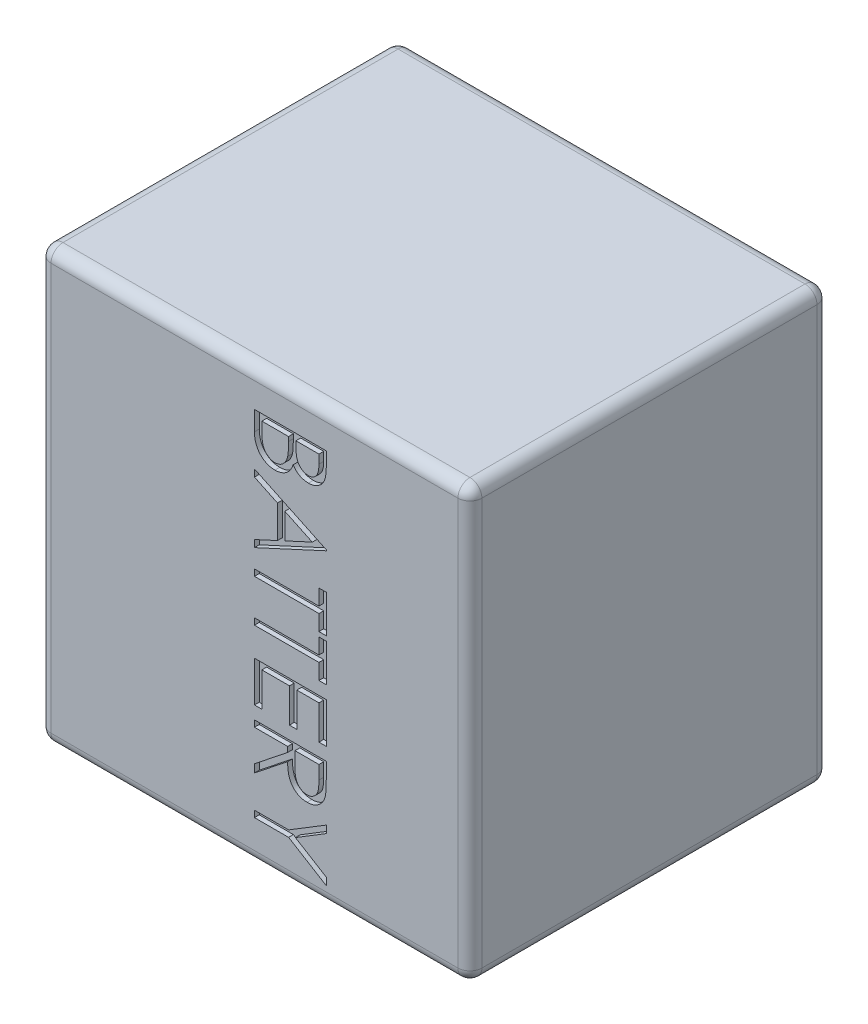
from build123d import *

# Parameters (mm, degrees)
ESQUISSE1_W             = 180
ESQUISSE1_H             = 180
BOSS_EXTRU_1_DEPTH      = 150
CONG_1_R                = 5
ENL_V_MAT_EXTRU_1_DEPTH = 2
ENL_V_MAT_EXTRU_2_DEPTH = 2
ENL_V_MAT_EXTRU_3_DEPTH = 2


with BuildPart() as part:
    # Esquisse1 → Boss.-Extru.1 (new body)
    with BuildSketch(Plane.XY):
        with Locations((-90, -90)):
            Rectangle(ESQUISSE1_W, ESQUISSE1_H)
    extrude(amount=BOSS_EXTRU_1_DEPTH)

    # Cong_1
    cong_1_edges = [part.edges().sort_by_distance(p)[0] for p in [
        (-180, -90, 150),
        (-90, -180, 150),
        (0, -90, 150),
        (-90, -180, 0),
        (-180, -90, 0),
        (-90, 0, 0),
        (0, -90, 0),
        (0, -180, 75),
        (-180, -180, 75),
        (-180, 0, 75),
        (0, 0, 75),
        (-90, 0, 150),
    ]]
    fillet(cong_1_edges, radius=CONG_1_R)

    # Esquisse2 → Enl_v. mat.-Extru.1 (cut)
    # profile 1 of 7: a face of its own
    with BuildSketch(Plane.XY.offset(150)):
        with BuildLine():
            Line((-60, -15.384615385), (-60, -21.237980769))
            add(Edge.make_bspline(
                [(-60, -21.237980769), (-60.001506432, -21.524510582), (-60.004426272, -22.079876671), (-60.049710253, -22.887471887), (-60.111455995, -23.643890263), (-60.209428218, -24.349351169), (-60.327643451, -25.003528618), (-60.470801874, -25.60839408), (-60.642458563, -26.162024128), (-60.915426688, -26.82299044), (-61.321053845, -27.576596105), (-61.920441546, -28.392582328), (-62.653576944, -29.090332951), (-63.480571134, -29.691929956), (-64.39030632, -30.170225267), (-65.361099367, -30.516247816), (-66.380428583, -30.735315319), (-67.080227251, -30.757844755), (-67.433894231, -30.769230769)],
                knots=[0, 0, 0, 0, 1.001505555, 1.941167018, 2.826882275, 3.653841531, 4.429895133, 5.150066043, 5.825578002, 6.45369114, 7.647487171, 8.808567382, 9.977351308, 11.170798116, 12.373658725, 13.556498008, 14.765093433, 16, 16, 16, 16], degree=3))
            add(Edge.make_bspline(
                [(-67.433894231, -30.769230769), (-67.765257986, -30.760041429), (-68.416419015, -30.741983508), (-69.36727989, -30.563426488), (-70.276147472, -30.297580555), (-71.131817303, -29.911650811), (-71.923292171, -29.415225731), (-72.645868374, -28.817835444), (-73.282034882, -28.106564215), (-73.636203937, -27.572807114), (-73.816105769, -27.301682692)],
                knots=[0, 0, 0, 0, 1.044266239, 2.052081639, 3.041743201, 4.026043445, 5.00270663, 5.980942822, 6.97441044, 8, 8, 8, 8], degree=3))
            add(Edge.make_bspline(
                [(-73.816105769, -27.301682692), (-73.946847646, -27.642543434), (-74.196989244, -28.294694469), (-74.641642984, -29.19278574), (-75.119819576, -29.96965462), (-75.644776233, -30.626156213), (-76.217699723, -31.179157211), (-76.827117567, -31.675763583), (-77.50303226, -32.091808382), (-78.226197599, -32.449225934), (-78.991538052, -32.7305098), (-79.795553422, -32.929536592), (-80.629253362, -33.051828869), (-81.197504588, -33.068504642), (-81.484375, -33.076923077)],
                knots=[0, 0, 0, 0, 1.272302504, 2.434229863, 3.488457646, 4.447234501, 5.35599188, 6.26022912, 7.18267843, 8.11661068, 9.06895546, 10.019249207, 11.000057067, 12, 12, 12, 12], degree=3))
            add(Edge.make_bspline(
                [(-81.484375, -33.076923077), (-81.777232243, -33.068547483), (-82.353437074, -33.052068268), (-83.199933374, -32.930563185), (-84.008774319, -32.724632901), (-84.785710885, -32.441673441), (-85.526345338, -32.070277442), (-86.239953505, -31.628041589), (-86.907525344, -31.08978451), (-87.544936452, -30.489820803), (-88.117708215, -29.810297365), (-88.627634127, -29.077251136), (-89.048919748, -28.280138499), (-89.398386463, -27.431320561), (-89.669221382, -26.525156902), (-89.857247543, -25.565007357), (-89.9842348, -24.550663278), (-89.994655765, -23.854574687), (-90, -23.497596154)],
                knots=[0, 0, 0, 0, 0.978404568, 1.925038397, 2.85041836, 3.763147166, 4.682162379, 5.614488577, 6.562659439, 7.54271123, 8.535210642, 9.526693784, 10.520907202, 11.541451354, 12.589717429, 13.675358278, 14.807842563, 16, 16, 16, 16], degree=3))
            Line((-90, -23.497596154), (-90, -15.384615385))
            Line((-90, -15.384615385), (-60, -15.384615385))
        make_face()
        with BuildLine():
            Line((-63.076923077, -18.076923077), (-72.692307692, -18.076923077))
            Line((-72.692307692, -18.076923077), (-72.692307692, -19.885817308))
            add(Edge.make_bspline(
                [(-72.692307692, -19.885817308), (-72.688908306, -20.150237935), (-72.68234, -20.661152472), (-72.662931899, -21.403003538), (-72.610968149, -22.089894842), (-72.556007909, -22.724193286), (-72.471380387, -23.301647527), (-72.367820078, -23.824190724), (-72.259253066, -24.296516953), (-72.074099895, -24.840965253), (-71.803237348, -25.458362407), (-71.372996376, -26.11234795), (-70.874468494, -26.698250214), (-70.288623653, -27.187471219), (-69.649010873, -27.591164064), (-68.955573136, -27.860571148), (-68.235382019, -28.051658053), (-67.73966656, -28.068415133), (-67.487980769, -28.076923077)],
                knots=[0, 0, 0, 0, 1.156481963, 2.23455883, 3.244418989, 4.168404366, 5.01828131, 5.794834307, 6.498111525, 7.13526334, 8.307595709, 9.435046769, 10.546766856, 11.659452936, 12.760769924, 13.837671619, 14.902137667, 16, 16, 16, 16], degree=3))
            add(Edge.make_bspline(
                [(-67.487980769, -28.076923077), (-67.321395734, -28.072667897), (-66.994620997, -28.064320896), (-66.520093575, -27.988353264), (-66.068089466, -27.878123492), (-65.649004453, -27.70591096), (-65.25092694, -27.497670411), (-64.891538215, -27.22678725), (-64.551148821, -26.920868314), (-64.242257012, -26.561596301), (-63.965488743, -26.150710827), (-63.721956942, -25.684296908), (-63.529852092, -25.156785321), (-63.357523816, -24.580136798), (-63.237946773, -23.945122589), (-63.13796444, -23.25794765), (-63.087140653, -22.512782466), (-63.080404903, -21.997254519), (-63.076923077, -21.730769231)],
                knots=[0, 0, 0, 0, 0.911752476, 1.788502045, 2.626783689, 3.45400582, 4.26402138, 5.080402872, 5.911472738, 6.767166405, 7.66795952, 8.620018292, 9.640966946, 10.73819047, 11.913090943, 13.176185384, 14.540321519, 16, 16, 16, 16], degree=3))
            Line((-63.076923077, -21.730769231), (-63.076923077, -18.076923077))
        make_face(mode=Mode.SUBTRACT)
        with BuildLine():
            Line((-75.769230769, -18.076923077), (-86.923076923, -18.076923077))
            Line((-86.923076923, -18.076923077), (-86.923076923, -21.911057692))
            add(Edge.make_bspline(
                [(-86.923076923, -21.911057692), (-86.919799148, -22.185506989), (-86.913481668, -22.714471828), (-86.892632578, -23.478178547), (-86.846204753, -24.184107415), (-86.770515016, -24.832664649), (-86.691866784, -25.429559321), (-86.583013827, -25.968861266), (-86.459261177, -26.451397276), (-86.267748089, -27.01083891), (-85.970736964, -27.641210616), (-85.519990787, -28.320057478), (-84.990067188, -28.929634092), (-84.369016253, -29.441343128), (-83.698842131, -29.863892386), (-82.983050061, -30.160250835), (-82.24347672, -30.350805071), (-81.73791829, -30.373322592), (-81.484375, -30.384615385)],
                knots=[0, 0, 0, 0, 1.159821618, 2.235403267, 3.228114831, 4.14795534, 4.994323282, 5.771256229, 6.471395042, 7.097801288, 8.267864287, 9.404187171, 10.531774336, 11.667624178, 12.792825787, 13.866573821, 14.930062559, 16, 16, 16, 16], degree=3))
            add(Edge.make_bspline(
                [(-81.484375, -30.384615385), (-81.325840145, -30.382307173), (-81.011327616, -30.377727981), (-80.549491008, -30.306071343), (-80.100128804, -30.206105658), (-79.670036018, -30.061346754), (-79.252214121, -29.878817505), (-78.853940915, -29.649750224), (-78.465693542, -29.385220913), (-77.975425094, -28.971409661), (-77.410360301, -28.370082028), (-76.857202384, -27.515403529), (-76.411072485, -26.543654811), (-76.221649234, -25.838845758), (-76.123798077, -25.474759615)],
                knots=[0, 0, 0, 0, 0.723503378, 1.435336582, 2.130201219, 2.824764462, 3.504949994, 4.209866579, 4.920640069, 5.648298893, 7.13757748, 8.670694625, 10.280166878, 12, 12, 12, 12], degree=3))
            add(Edge.make_bspline(
                [(-76.123798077, -25.474759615), (-76.094181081, -25.328796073), (-76.029965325, -25.012317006), (-75.96222329, -24.496249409), (-75.901456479, -23.905109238), (-75.857687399, -23.241423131), (-75.810702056, -22.502551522), (-75.793079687, -21.688731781), (-75.771570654, -20.79938857), (-75.770030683, -20.182310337), (-75.769230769, -19.861778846)],
                knots=[0, 0, 0, 0, 0.634452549, 1.375623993, 2.216454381, 3.166361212, 4.209414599, 5.370755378, 6.634280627, 8, 8, 8, 8], degree=3))
            Line((-75.769230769, -19.861778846), (-75.769230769, -18.076923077))
        make_face(mode=Mode.SUBTRACT)
    # profile 2 of 7: a face of its own
    with BuildSketch(Plane.XY.offset(150)):
        Polygon((-60, -51.538461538), (-90, -65.384615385), (-90, -62.457932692), (-80.384615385, -58.022836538), (-80.384615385, -44.423076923), (-90, -39.861778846), (-90, -36.923076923), (-60, -51.153846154), align=None)
        Polygon((-65.847355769, -51.316105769), (-77.307692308, -45.883413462), (-77.307692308, -56.604567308), align=None, mode=Mode.SUBTRACT)
    # profile 3 of 7: a face of its own
    with BuildSketch(Plane.XY.offset(150)):
        Polygon((-63.076923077, -66.538461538), (-60, -66.538461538), (-60, -82.307692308), (-63.076923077, -82.307692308), (-63.076923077, -75.769230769), (-90, -75.769230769), (-90, -73.076923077), (-63.076923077, -73.076923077), align=None)
    # profile 4 of 7: a face of its own
    with BuildSketch(Plane.XY.offset(150)):
        Polygon((-63.076923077, -84.230769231), (-60, -84.230769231), (-60, -100), (-63.076923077, -100), (-63.076923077, -93.461538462), (-90, -93.461538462), (-90, -90.769230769), (-63.076923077, -90.769230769), align=None)
    # profile 5 of 7: a face of its own
    with BuildSketch(Plane.XY.offset(150)):
        Polygon((-60, -105.384615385), (-60, -122.307692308), (-63.076923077, -122.307692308), (-63.076923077, -108.076923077), (-72.307692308, -108.076923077), (-72.307692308, -122.307692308), (-75.384615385, -122.307692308), (-75.384615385, -108.076923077), (-86.923076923, -108.076923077), (-86.923076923, -122.307692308), (-90, -122.307692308), (-90, -105.384615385), align=None)
    # profile 6 of 7: a face of its own
    with BuildSketch(Plane.XY.offset(150)):
        with BuildLine():
            Line((-60, -127.692307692), (-60, -133.695913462))
            add(Edge.make_bspline(
                [(-60, -133.695913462), (-60.001333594, -134.096551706), (-60.003894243, -134.865821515), (-60.018172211, -135.967878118), (-60.059095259, -136.969253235), (-60.094311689, -137.869423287), (-60.158528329, -138.668371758), (-60.219905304, -139.368548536), (-60.300250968, -139.9667288), (-60.374868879, -140.328836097), (-60.408653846, -140.492788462)],
                knots=[0, 0, 0, 0, 1.410062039, 2.707475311, 3.878576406, 4.937260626, 5.877586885, 6.699081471, 7.410979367, 8, 8, 8, 8], degree=3))
            add(Edge.make_bspline(
                [(-60.408653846, -140.492788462), (-60.462877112, -140.712277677), (-60.570166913, -141.146573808), (-60.797052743, -141.771804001), (-61.05917739, -142.36784799), (-61.369442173, -142.932468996), (-61.722435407, -143.465719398), (-62.120219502, -143.966800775), (-62.564820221, -144.432848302), (-63.044884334, -144.867447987), (-63.564600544, -145.261398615), (-64.116397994, -145.602311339), (-64.696825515, -145.894233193), (-65.307904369, -146.127283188), (-65.944468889, -146.314764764), (-66.612077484, -146.44700178), (-67.307745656, -146.526294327), (-67.782241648, -146.534367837), (-68.022836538, -146.538461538)],
                knots=[0, 0, 0, 0, 1.02737288, 2.032829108, 3.019628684, 3.985738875, 4.958353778, 5.924249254, 6.890702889, 7.883913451, 8.865824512, 9.85161466, 10.829249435, 11.81541824, 12.821369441, 13.843154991, 14.906364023, 16, 16, 16, 16], degree=3))
            add(Edge.make_bspline(
                [(-68.022836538, -146.538461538), (-68.422566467, -146.525870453), (-69.202543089, -146.501301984), (-70.334487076, -146.272225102), (-71.390418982, -145.897014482), (-72.368869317, -145.379896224), (-73.251280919, -144.721671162), (-74.023710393, -143.930634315), (-74.676062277, -143.010825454), (-75.123633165, -142.150523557), (-75.411619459, -141.390217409), (-75.615264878, -140.76244881), (-75.76995325, -140.077139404), (-75.910543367, -139.344120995), (-76.01782492, -138.557731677), (-76.094015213, -137.719555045), (-76.14300615, -136.827494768), (-76.150163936, -136.216011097), (-76.153846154, -135.901442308)],
                knots=[0, 0, 0, 0, 1.260402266, 2.459371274, 3.627181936, 4.786749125, 5.93865593, 7.087644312, 8.261344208, 9.485713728, 10.136162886, 10.825977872, 11.566646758, 12.35154167, 13.181268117, 14.0701832, 15.007234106, 16, 16, 16, 16], degree=3))
            Line((-76.153846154, -135.901442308), (-90, -146.923076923))
            Line((-90, -146.923076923), (-90, -143.59375))
            Line((-90, -143.59375), (-76.153846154, -132.572115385))
            Line((-76.153846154, -132.572115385), (-76.153846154, -130.384615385))
            Line((-76.153846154, -130.384615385), (-90, -130.384615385))
            Line((-90, -130.384615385), (-90, -127.692307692))
            Line((-90, -127.692307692), (-60, -127.692307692))
        make_face()
        with BuildLine():
            Line((-63.076923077, -130.384615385), (-73.076923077, -130.384615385))
            Line((-73.076923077, -130.384615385), (-73.118990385, -135.877403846))
            add(Edge.make_bspline(
                [(-73.118990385, -135.877403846), (-73.119103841, -136.133861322), (-73.119323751, -136.630948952), (-73.085091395, -137.350097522), (-73.046148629, -138.01969843), (-72.986582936, -138.637190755), (-72.909816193, -139.202849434), (-72.813791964, -139.716394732), (-72.701912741, -140.178655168), (-72.528774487, -140.717809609), (-72.254311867, -141.319674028), (-71.85567055, -141.97458297), (-71.351022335, -142.530398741), (-70.783136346, -143.009619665), (-70.145915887, -143.378741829), (-69.467644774, -143.647398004), (-68.754178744, -143.815994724), (-68.264134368, -143.836038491), (-68.016826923, -143.846153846)],
                knots=[0, 0, 0, 0, 1.14660753, 2.222451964, 3.218720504, 4.145691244, 4.995719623, 5.770487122, 6.480909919, 7.121111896, 8.299844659, 9.430703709, 10.534634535, 11.641396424, 12.741395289, 13.810956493, 14.895269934, 16, 16, 16, 16], degree=3))
            add(Edge.make_bspline(
                [(-68.016826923, -143.846153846), (-67.775503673, -143.836007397), (-67.297289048, -143.815900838), (-66.599116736, -143.647071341), (-65.935457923, -143.374436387), (-65.318962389, -142.992139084), (-64.754688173, -142.530191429), (-64.278554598, -141.981559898), (-63.87982048, -141.37387425), (-63.626876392, -140.805500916), (-63.471488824, -140.297831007), (-63.362278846, -139.856984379), (-63.273797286, -139.356972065), (-63.205004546, -138.798992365), (-63.14309894, -138.184054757), (-63.102960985, -137.510475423), (-63.078701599, -136.779032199), (-63.077529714, -136.272056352), (-63.076923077, -136.009615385)],
                knots=[0, 0, 0, 0, 1.100801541, 2.181386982, 3.260112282, 4.364594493, 5.481957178, 6.577424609, 7.668452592, 8.790448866, 9.403819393, 10.091598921, 10.863153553, 11.720938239, 12.658472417, 13.685008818, 14.801622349, 16, 16, 16, 16], degree=3))
            Line((-63.076923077, -136.009615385), (-63.076923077, -130.384615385))
        make_face(mode=Mode.SUBTRACT)
    # profile 7 of 7: a face of its own
    with BuildSketch(Plane.XY.offset(150)):
        Polygon((-60, -150.769230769), (-60, -153.852163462), (-72.890625, -161.736778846), (-60, -169.609375), (-60, -172.692307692), (-75.739182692, -163.076923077), (-90, -163.076923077), (-90, -160.384615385), (-75.739182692, -160.384615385), align=None)
    extrude(amount=-ENL_V_MAT_EXTRU_1_DEPTH, mode=Mode.SUBTRACT)

    # Esquisse3 → Enl_v. mat.-Extru.2 (cut)
    # profile 1 of 7: a face of its own
    with BuildSketch(Plane.ZY.offset(180)):
        with BuildLine():
            Line((105, -15.384615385), (105, -21.237980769))
            add(Edge.make_bspline(
                [(105, -21.237980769), (104.998493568, -21.524510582), (104.995573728, -22.079876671), (104.950289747, -22.887471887), (104.888544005, -23.643890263), (104.790571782, -24.349351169), (104.672356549, -25.003528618), (104.529198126, -25.60839408), (104.357541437, -26.162024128), (104.084573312, -26.82299044), (103.678946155, -27.576596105), (103.079558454, -28.392582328), (102.346423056, -29.090332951), (101.519428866, -29.691929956), (100.60969368, -30.170225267), (99.638900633, -30.516247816), (98.619571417, -30.735315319), (97.919772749, -30.757844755), (97.566105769, -30.769230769)],
                knots=[0, 0, 0, 0, 1.001505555, 1.941167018, 2.826882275, 3.653841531, 4.429895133, 5.150066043, 5.825578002, 6.45369114, 7.647487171, 8.808567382, 9.977351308, 11.170798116, 12.373658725, 13.556498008, 14.765093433, 16, 16, 16, 16], degree=3))
            add(Edge.make_bspline(
                [(97.566105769, -30.769230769), (97.234742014, -30.760041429), (96.583580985, -30.741983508), (95.63272011, -30.563426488), (94.723852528, -30.297580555), (93.868182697, -29.911650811), (93.076707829, -29.415225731), (92.354131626, -28.817835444), (91.717965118, -28.106564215), (91.363796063, -27.572807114), (91.183894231, -27.301682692)],
                knots=[0, 0, 0, 0, 1.044266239, 2.052081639, 3.041743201, 4.026043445, 5.00270663, 5.980942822, 6.97441044, 8, 8, 8, 8], degree=3))
            add(Edge.make_bspline(
                [(91.183894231, -27.301682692), (91.053152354, -27.642543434), (90.803010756, -28.294694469), (90.358357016, -29.19278574), (89.880180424, -29.96965462), (89.355223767, -30.626156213), (88.782300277, -31.179157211), (88.172882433, -31.675763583), (87.49696774, -32.091808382), (86.773802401, -32.449225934), (86.008461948, -32.7305098), (85.204446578, -32.929536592), (84.370746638, -33.051828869), (83.802495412, -33.068504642), (83.515625, -33.076923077)],
                knots=[0, 0, 0, 0, 1.272302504, 2.434229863, 3.488457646, 4.447234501, 5.35599188, 6.26022912, 7.18267843, 8.11661068, 9.06895546, 10.019249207, 11.000057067, 12, 12, 12, 12], degree=3))
            add(Edge.make_bspline(
                [(83.515625, -33.076923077), (83.222767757, -33.068547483), (82.646562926, -33.052068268), (81.800066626, -32.930563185), (80.991225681, -32.724632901), (80.214289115, -32.441673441), (79.473654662, -32.070277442), (78.760046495, -31.628041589), (78.092474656, -31.08978451), (77.455063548, -30.489820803), (76.882291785, -29.810297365), (76.372365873, -29.077251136), (75.951080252, -28.280138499), (75.601613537, -27.431320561), (75.330778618, -26.525156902), (75.142752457, -25.565007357), (75.0157652, -24.550663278), (75.005344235, -23.854574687), (75, -23.497596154)],
                knots=[0, 0, 0, 0, 0.978404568, 1.925038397, 2.85041836, 3.763147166, 4.682162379, 5.614488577, 6.562659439, 7.54271123, 8.535210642, 9.526693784, 10.520907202, 11.541451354, 12.589717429, 13.675358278, 14.807842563, 16, 16, 16, 16], degree=3))
            Line((75, -23.497596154), (75, -15.384615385))
            Line((75, -15.384615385), (105, -15.384615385))
        make_face()
        with BuildLine():
            Line((101.923076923, -18.076923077), (92.307692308, -18.076923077))
            Line((92.307692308, -18.076923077), (92.307692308, -19.885817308))
            add(Edge.make_bspline(
                [(92.307692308, -19.885817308), (92.311091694, -20.150237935), (92.31766, -20.661152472), (92.337068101, -21.403003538), (92.389031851, -22.089894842), (92.443992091, -22.724193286), (92.528619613, -23.301647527), (92.632179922, -23.824190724), (92.740746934, -24.296516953), (92.925900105, -24.840965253), (93.196762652, -25.458362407), (93.627003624, -26.11234795), (94.125531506, -26.698250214), (94.711376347, -27.187471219), (95.350989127, -27.591164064), (96.044426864, -27.860571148), (96.764617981, -28.051658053), (97.26033344, -28.068415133), (97.512019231, -28.076923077)],
                knots=[0, 0, 0, 0, 1.156481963, 2.23455883, 3.244418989, 4.168404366, 5.01828131, 5.794834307, 6.498111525, 7.13526334, 8.307595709, 9.435046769, 10.546766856, 11.659452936, 12.760769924, 13.837671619, 14.902137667, 16, 16, 16, 16], degree=3))
            add(Edge.make_bspline(
                [(97.512019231, -28.076923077), (97.678604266, -28.072667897), (98.005379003, -28.064320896), (98.479906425, -27.988353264), (98.931910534, -27.878123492), (99.350995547, -27.70591096), (99.74907306, -27.497670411), (100.108461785, -27.22678725), (100.448851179, -26.920868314), (100.757742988, -26.561596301), (101.034511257, -26.150710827), (101.278043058, -25.684296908), (101.470147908, -25.156785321), (101.642476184, -24.580136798), (101.762053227, -23.945122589), (101.86203556, -23.25794765), (101.912859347, -22.512782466), (101.919595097, -21.997254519), (101.923076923, -21.730769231)],
                knots=[0, 0, 0, 0, 0.911752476, 1.788502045, 2.626783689, 3.45400582, 4.26402138, 5.080402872, 5.911472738, 6.767166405, 7.66795952, 8.620018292, 9.640966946, 10.73819047, 11.913090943, 13.176185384, 14.540321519, 16, 16, 16, 16], degree=3))
            Line((101.923076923, -21.730769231), (101.923076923, -18.076923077))
        make_face(mode=Mode.SUBTRACT)
        with BuildLine():
            Line((89.230769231, -18.076923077), (78.076923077, -18.076923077))
            Line((78.076923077, -18.076923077), (78.076923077, -21.911057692))
            add(Edge.make_bspline(
                [(78.076923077, -21.911057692), (78.080200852, -22.185506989), (78.086518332, -22.714471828), (78.107367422, -23.478178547), (78.153795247, -24.184107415), (78.229484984, -24.832664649), (78.308133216, -25.429559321), (78.416986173, -25.968861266), (78.540738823, -26.451397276), (78.732251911, -27.01083891), (79.029263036, -27.641210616), (79.480009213, -28.320057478), (80.009932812, -28.929634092), (80.630983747, -29.441343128), (81.301157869, -29.863892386), (82.016949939, -30.160250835), (82.75652328, -30.350805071), (83.26208171, -30.373322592), (83.515625, -30.384615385)],
                knots=[0, 0, 0, 0, 1.159821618, 2.235403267, 3.228114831, 4.14795534, 4.994323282, 5.771256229, 6.471395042, 7.097801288, 8.267864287, 9.404187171, 10.531774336, 11.667624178, 12.792825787, 13.866573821, 14.930062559, 16, 16, 16, 16], degree=3))
            add(Edge.make_bspline(
                [(83.515625, -30.384615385), (83.674159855, -30.382307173), (83.988672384, -30.377727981), (84.450508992, -30.306071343), (84.899871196, -30.206105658), (85.329963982, -30.061346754), (85.747785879, -29.878817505), (86.146059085, -29.649750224), (86.534306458, -29.385220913), (87.024574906, -28.971409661), (87.589639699, -28.370082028), (88.142797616, -27.515403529), (88.588927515, -26.543654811), (88.778350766, -25.838845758), (88.876201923, -25.474759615)],
                knots=[0, 0, 0, 0, 0.723503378, 1.435336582, 2.130201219, 2.824764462, 3.504949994, 4.209866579, 4.920640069, 5.648298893, 7.13757748, 8.670694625, 10.280166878, 12, 12, 12, 12], degree=3))
            add(Edge.make_bspline(
                [(88.876201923, -25.474759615), (88.905818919, -25.328796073), (88.970034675, -25.012317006), (89.03777671, -24.496249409), (89.098543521, -23.905109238), (89.142312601, -23.241423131), (89.189297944, -22.502551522), (89.206920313, -21.688731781), (89.228429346, -20.79938857), (89.229969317, -20.182310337), (89.230769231, -19.861778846)],
                knots=[0, 0, 0, 0, 0.634452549, 1.375623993, 2.216454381, 3.166361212, 4.209414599, 5.370755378, 6.634280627, 8, 8, 8, 8], degree=3))
            Line((89.230769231, -19.861778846), (89.230769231, -18.076923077))
        make_face(mode=Mode.SUBTRACT)
    # profile 2 of 7: a face of its own
    with BuildSketch(Plane.ZY.offset(180)):
        Polygon((105, -51.538461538), (75, -65.384615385), (75, -62.457932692), (84.615384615, -58.022836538), (84.615384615, -44.423076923), (75, -39.861778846), (75, -36.923076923), (105, -51.153846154), align=None)
        Polygon((99.152644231, -51.316105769), (87.692307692, -45.883413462), (87.692307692, -56.604567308), align=None, mode=Mode.SUBTRACT)
    # profile 3 of 7: a face of its own
    with BuildSketch(Plane.ZY.offset(180)):
        Polygon((101.923076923, -66.538461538), (105, -66.538461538), (105, -82.307692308), (101.923076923, -82.307692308), (101.923076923, -75.769230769), (75, -75.769230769), (75, -73.076923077), (101.923076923, -73.076923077), align=None)
    # profile 4 of 7: a face of its own
    with BuildSketch(Plane.ZY.offset(180)):
        Polygon((101.923076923, -84.230769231), (105, -84.230769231), (105, -100), (101.923076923, -100), (101.923076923, -93.461538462), (75, -93.461538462), (75, -90.769230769), (101.923076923, -90.769230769), align=None)
    # profile 5 of 7: a face of its own
    with BuildSketch(Plane.ZY.offset(180)):
        Polygon((105, -105.384615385), (105, -122.307692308), (101.923076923, -122.307692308), (101.923076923, -108.076923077), (92.692307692, -108.076923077), (92.692307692, -122.307692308), (89.615384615, -122.307692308), (89.615384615, -108.076923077), (78.076923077, -108.076923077), (78.076923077, -122.307692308), (75, -122.307692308), (75, -105.384615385), align=None)
    # profile 6 of 7: a face of its own
    with BuildSketch(Plane.ZY.offset(180)):
        with BuildLine():
            Line((105, -127.692307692), (105, -133.695913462))
            add(Edge.make_bspline(
                [(105, -133.695913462), (104.998666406, -134.096551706), (104.996105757, -134.865821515), (104.981827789, -135.967878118), (104.940904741, -136.969253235), (104.905688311, -137.869423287), (104.841471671, -138.668371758), (104.780094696, -139.368548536), (104.699749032, -139.9667288), (104.625131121, -140.328836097), (104.591346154, -140.492788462)],
                knots=[0, 0, 0, 0, 1.410062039, 2.707475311, 3.878576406, 4.937260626, 5.877586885, 6.699081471, 7.410979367, 8, 8, 8, 8], degree=3))
            add(Edge.make_bspline(
                [(104.591346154, -140.492788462), (104.537122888, -140.712277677), (104.429833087, -141.146573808), (104.202947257, -141.771804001), (103.94082261, -142.36784799), (103.630557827, -142.932468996), (103.277564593, -143.465719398), (102.879780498, -143.966800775), (102.435179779, -144.432848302), (101.955115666, -144.867447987), (101.435399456, -145.261398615), (100.883602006, -145.602311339), (100.303174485, -145.894233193), (99.692095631, -146.127283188), (99.055531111, -146.314764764), (98.387922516, -146.44700178), (97.692254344, -146.526294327), (97.217758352, -146.534367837), (96.977163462, -146.538461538)],
                knots=[0, 0, 0, 0, 1.02737288, 2.032829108, 3.019628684, 3.985738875, 4.958353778, 5.924249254, 6.890702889, 7.883913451, 8.865824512, 9.85161466, 10.829249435, 11.81541824, 12.821369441, 13.843154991, 14.906364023, 16, 16, 16, 16], degree=3))
            add(Edge.make_bspline(
                [(96.977163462, -146.538461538), (96.577433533, -146.525870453), (95.797456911, -146.501301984), (94.665512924, -146.272225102), (93.609581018, -145.897014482), (92.631130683, -145.379896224), (91.748719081, -144.721671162), (90.976289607, -143.930634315), (90.323937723, -143.010825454), (89.876366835, -142.150523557), (89.588380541, -141.390217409), (89.384735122, -140.76244881), (89.23004675, -140.077139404), (89.089456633, -139.344120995), (88.98217508, -138.557731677), (88.905984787, -137.719555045), (88.85699385, -136.827494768), (88.849836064, -136.216011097), (88.846153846, -135.901442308)],
                knots=[0, 0, 0, 0, 1.260402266, 2.459371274, 3.627181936, 4.786749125, 5.93865593, 7.087644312, 8.261344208, 9.485713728, 10.136162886, 10.825977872, 11.566646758, 12.35154167, 13.181268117, 14.0701832, 15.007234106, 16, 16, 16, 16], degree=3))
            Line((88.846153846, -135.901442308), (75, -146.923076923))
            Line((75, -146.923076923), (75, -143.59375))
            Line((75, -143.59375), (88.846153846, -132.572115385))
            Line((88.846153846, -132.572115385), (88.846153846, -130.384615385))
            Line((88.846153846, -130.384615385), (75, -130.384615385))
            Line((75, -130.384615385), (75, -127.692307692))
            Line((75, -127.692307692), (105, -127.692307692))
        make_face()
        with BuildLine():
            Line((101.923076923, -130.384615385), (91.923076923, -130.384615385))
            Line((91.923076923, -130.384615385), (91.881009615, -135.877403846))
            add(Edge.make_bspline(
                [(91.881009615, -135.877403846), (91.880896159, -136.133861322), (91.880676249, -136.630948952), (91.914908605, -137.350097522), (91.953851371, -138.01969843), (92.013417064, -138.637190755), (92.090183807, -139.202849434), (92.186208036, -139.716394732), (92.298087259, -140.178655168), (92.471225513, -140.717809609), (92.745688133, -141.319674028), (93.14432945, -141.97458297), (93.648977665, -142.530398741), (94.216863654, -143.009619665), (94.854084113, -143.378741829), (95.532355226, -143.647398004), (96.245821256, -143.815994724), (96.735865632, -143.836038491), (96.983173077, -143.846153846)],
                knots=[0, 0, 0, 0, 1.14660753, 2.222451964, 3.218720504, 4.145691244, 4.995719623, 5.770487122, 6.480909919, 7.121111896, 8.299844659, 9.430703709, 10.534634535, 11.641396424, 12.741395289, 13.810956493, 14.895269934, 16, 16, 16, 16], degree=3))
            add(Edge.make_bspline(
                [(96.983173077, -143.846153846), (97.224496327, -143.836007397), (97.702710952, -143.815900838), (98.400883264, -143.647071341), (99.064542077, -143.374436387), (99.681037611, -142.992139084), (100.245311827, -142.530191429), (100.721445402, -141.981559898), (101.12017952, -141.37387425), (101.373123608, -140.805500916), (101.528511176, -140.297831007), (101.637721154, -139.856984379), (101.726202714, -139.356972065), (101.794995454, -138.798992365), (101.85690106, -138.184054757), (101.897039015, -137.510475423), (101.921298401, -136.779032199), (101.922470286, -136.272056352), (101.923076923, -136.009615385)],
                knots=[0, 0, 0, 0, 1.100801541, 2.181386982, 3.260112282, 4.364594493, 5.481957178, 6.577424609, 7.668452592, 8.790448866, 9.403819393, 10.091598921, 10.863153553, 11.720938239, 12.658472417, 13.685008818, 14.801622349, 16, 16, 16, 16], degree=3))
            Line((101.923076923, -136.009615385), (101.923076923, -130.384615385))
        make_face(mode=Mode.SUBTRACT)
    # profile 7 of 7: a face of its own
    with BuildSketch(Plane.ZY.offset(180)):
        Polygon((105, -150.769230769), (105, -153.852163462), (92.109375, -161.736778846), (105, -169.609375), (105, -172.692307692), (89.260817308, -163.076923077), (75, -163.076923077), (75, -160.384615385), (89.260817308, -160.384615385), align=None)
    extrude(amount=-ENL_V_MAT_EXTRU_2_DEPTH, mode=Mode.SUBTRACT)

    # Esquisse4 → Enl_v. mat.-Extru.3 (cut)
    # profile 1 of 7: a face of its own
    with BuildSketch(Plane.XZ.offset(180)):
        with BuildLine():
            Line((-167.115384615, 105), (-161.262019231, 105))
            add(Edge.make_bspline(
                [(-161.262019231, 105), (-160.975489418, 104.998493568), (-160.420123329, 104.995573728), (-159.612528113, 104.950289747), (-158.856109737, 104.888544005), (-158.150648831, 104.790571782), (-157.496471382, 104.672356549), (-156.89160592, 104.529198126), (-156.337975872, 104.357541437), (-155.67700956, 104.084573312), (-154.923403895, 103.678946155), (-154.107417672, 103.079558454), (-153.409667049, 102.346423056), (-152.808070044, 101.519428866), (-152.329774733, 100.60969368), (-151.983752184, 99.638900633), (-151.764684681, 98.619571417), (-151.742155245, 97.919772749), (-151.730769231, 97.566105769)],
                knots=[0, 0, 0, 0, 1.001505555, 1.941167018, 2.826882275, 3.653841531, 4.429895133, 5.150066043, 5.825578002, 6.45369114, 7.647487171, 8.808567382, 9.977351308, 11.170798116, 12.373658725, 13.556498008, 14.765093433, 16, 16, 16, 16], degree=3))
            add(Edge.make_bspline(
                [(-151.730769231, 97.566105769), (-151.740139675, 97.234798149), (-151.75855348, 96.583747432), (-151.934634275, 95.631512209), (-152.210297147, 94.725073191), (-152.593484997, 93.867738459), (-153.091502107, 93.078878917), (-153.681716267, 92.352130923), (-154.393803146, 91.71826472), (-154.927316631, 91.363896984), (-155.198317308, 91.183894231)],
                knots=[0, 0, 0, 0, 1.044552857, 2.05264487, 3.044412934, 4.028983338, 5.005914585, 5.980388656, 6.974128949, 8, 8, 8, 8], degree=3))
            add(Edge.make_bspline(
                [(-155.198317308, 91.183894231), (-154.857513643, 91.053051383), (-154.205471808, 90.802716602), (-153.30816313, 90.360126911), (-152.535064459, 89.878737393), (-151.880231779, 89.35303582), (-151.320194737, 88.786388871), (-150.831169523, 88.170487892), (-150.413900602, 87.497298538), (-150.056361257, 86.773839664), (-149.777371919, 86.007498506), (-149.568435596, 85.205463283), (-149.448714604, 84.370609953), (-149.431677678, 83.802449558), (-149.423076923, 83.515625)],
                knots=[0, 0, 0, 0, 1.27268992, 2.434971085, 3.483601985, 4.442670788, 5.356604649, 6.2567628, 7.179492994, 8.113709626, 9.066344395, 10.018646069, 10.999752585, 12, 12, 12, 12], degree=3))
            add(Edge.make_bspline(
                [(-149.423076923, 83.515625), (-149.431449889, 83.222766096), (-149.447923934, 82.646557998), (-149.569466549, 81.800085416), (-149.775258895, 80.991157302), (-150.058725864, 80.214541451), (-150.42868856, 79.471740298), (-150.878928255, 78.761912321), (-151.415770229, 78.092189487), (-152.016309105, 77.455129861), (-152.695698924, 76.882320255), (-153.428691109, 76.372185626), (-154.224516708, 75.952647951), (-155.070105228, 75.600224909), (-155.974942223, 75.331020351), (-156.934964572, 75.142684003), (-157.949344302, 75.015783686), (-158.645427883, 75.005350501), (-159.002403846, 75)],
                knots=[0, 0, 0, 0, 0.978564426, 1.925352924, 2.850884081, 3.763762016, 4.682927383, 5.618979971, 6.567305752, 7.547517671, 8.540179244, 9.531824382, 10.526200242, 11.540722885, 12.589160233, 13.674978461, 14.80764778, 16, 16, 16, 16], degree=3))
            Line((-159.002403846, 75), (-167.115384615, 75))
            Line((-167.115384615, 75), (-167.115384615, 105))
        make_face()
        with BuildLine():
            Line((-164.423076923, 101.923076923), (-164.423076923, 92.307692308))
            Line((-164.423076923, 92.307692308), (-162.614182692, 92.307692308))
            add(Edge.make_bspline(
                [(-162.614182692, 92.307692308), (-162.349764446, 92.311120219), (-161.83885451, 92.317743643), (-161.098969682, 92.336716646), (-160.412183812, 92.389842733), (-159.779682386, 92.44295355), (-159.202461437, 92.529307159), (-158.681799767, 92.632096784), (-158.209526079, 92.740807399), (-157.664901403, 92.925688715), (-157.047133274, 93.198925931), (-156.388563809, 93.622970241), (-155.807982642, 94.128036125), (-155.317721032, 94.710815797), (-154.916479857, 95.352525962), (-154.637790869, 96.042927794), (-154.448814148, 96.76481464), (-154.431743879, 97.260399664), (-154.423076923, 97.512019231)],
                knots=[0, 0, 0, 0, 1.156816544, 2.235205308, 3.236616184, 4.169592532, 5.011045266, 5.787822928, 6.49130361, 7.128639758, 8.301311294, 9.436451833, 10.541879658, 11.654887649, 12.756523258, 13.837046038, 14.901820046, 16, 16, 16, 16], degree=3))
            add(Edge.make_bspline(
                [(-154.423076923, 97.512019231), (-154.427587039, 97.678525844), (-154.436434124, 98.005146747), (-154.508891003, 98.481284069), (-154.632041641, 98.929087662), (-154.790221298, 99.354694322), (-155.011267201, 99.744795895), (-155.271525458, 100.11288043), (-155.585974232, 100.446412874), (-155.943894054, 100.758151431), (-156.355396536, 101.034533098), (-156.82023618, 101.276596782), (-157.344701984, 101.471517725), (-157.919955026, 101.642227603), (-158.554850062, 101.762127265), (-159.24206052, 101.862013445), (-159.987215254, 101.912865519), (-160.502744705, 101.919597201), (-160.769230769, 101.923076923)],
                knots=[0, 0, 0, 0, 0.91205012, 1.789085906, 2.630437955, 3.453916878, 4.269457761, 5.079663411, 5.91843418, 6.774407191, 7.675494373, 8.627863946, 9.638891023, 10.736472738, 11.911756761, 13.175263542, 14.539845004, 16, 16, 16, 16], degree=3))
            Line((-160.769230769, 101.923076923), (-164.423076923, 101.923076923))
        make_face(mode=Mode.SUBTRACT)
        with BuildLine():
            Line((-164.423076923, 89.230769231), (-164.423076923, 78.076923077))
            Line((-164.423076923, 78.076923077), (-160.588942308, 78.076923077))
            add(Edge.make_bspline(
                [(-160.588942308, 78.076923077), (-160.314494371, 78.08021234), (-159.785532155, 78.086551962), (-159.021807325, 78.107248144), (-158.31395215, 78.154324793), (-157.665196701, 78.228432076), (-157.068535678, 78.308818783), (-156.531126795, 78.416915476), (-156.048613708, 78.540763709), (-155.489119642, 78.732199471), (-154.859089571, 79.029597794), (-154.180139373, 79.478005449), (-153.576486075, 80.012205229), (-153.063869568, 80.630470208), (-152.643758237, 81.302738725), (-152.338140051, 82.015413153), (-152.149646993, 82.756717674), (-152.126828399, 83.262146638), (-152.115384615, 83.515625)],
                knots=[0, 0, 0, 0, 1.160039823, 2.235823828, 3.228722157, 4.157150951, 4.99529583, 5.772374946, 6.472645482, 7.099169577, 8.269452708, 9.405989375, 10.527446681, 11.663510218, 12.788923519, 13.866172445, 14.929861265, 16, 16, 16, 16], degree=3))
            add(Edge.make_bspline(
                [(-152.115384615, 83.515625), (-152.117751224, 83.674139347), (-152.122446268, 83.988611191), (-152.193251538, 84.450746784), (-152.296227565, 84.898397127), (-152.429354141, 85.33277776), (-152.623235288, 85.746035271), (-152.849577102, 86.146342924), (-153.114960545, 86.534229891), (-153.528481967, 87.024620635), (-154.12995612, 87.589623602), (-154.984585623, 88.142802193), (-155.956348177, 88.588926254), (-156.661155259, 88.778350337), (-157.025240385, 88.876201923)],
                knots=[0, 0, 0, 0, 0.723448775, 1.435228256, 2.130040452, 2.821711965, 3.505591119, 4.210454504, 4.921174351, 5.648778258, 7.137944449, 8.670945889, 10.280296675, 12, 12, 12, 12], degree=3))
            add(Edge.make_bspline(
                [(-157.025240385, 88.876201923), (-157.171204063, 88.905816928), (-157.487683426, 88.970028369), (-158.003748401, 89.037808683), (-158.592912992, 89.098194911), (-159.256537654, 89.142861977), (-159.995462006, 89.18903235), (-160.811264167, 89.20698796), (-161.700612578, 89.228410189), (-162.317690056, 89.229962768), (-162.638221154, 89.230769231)],
                knots=[0, 0, 0, 0, 0.634451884, 1.375622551, 2.216452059, 3.157844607, 4.20941857, 5.370758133, 6.634282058, 8, 8, 8, 8], degree=3))
            Line((-162.638221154, 89.230769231), (-164.423076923, 89.230769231))
        make_face(mode=Mode.SUBTRACT)
    # profile 2 of 7: a face of its own
    with BuildSketch(Plane.XZ.offset(180)):
        Polygon((-130.961538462, 105), (-117.115384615, 75), (-120.042067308, 75), (-124.477163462, 84.615384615), (-138.076923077, 84.615384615), (-142.638221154, 75), (-145.576923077, 75), (-131.346153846, 105), align=None)
        Polygon((-131.183894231, 99.152644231), (-136.616586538, 87.692307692), (-125.895432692, 87.692307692), align=None, mode=Mode.SUBTRACT)
    # profile 3 of 7: a face of its own
    with BuildSketch(Plane.XZ.offset(180)):
        Polygon((-115.192307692, 101.923076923), (-115.192307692, 105), (-99.423076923, 105), (-99.423076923, 101.923076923), (-105.961538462, 101.923076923), (-105.961538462, 75), (-108.653846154, 75), (-108.653846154, 101.923076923), align=None)
    # profile 4 of 7: a face of its own
    with BuildSketch(Plane.XZ.offset(180)):
        Polygon((-98.269230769, 101.923076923), (-98.269230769, 105), (-82.5, 105), (-82.5, 101.923076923), (-89.038461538, 101.923076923), (-89.038461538, 75), (-91.730769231, 75), (-91.730769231, 101.923076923), align=None)
    # profile 5 of 7: a face of its own
    with BuildSketch(Plane.XZ.offset(180)):
        Polygon((-77.884615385, 105), (-60.961538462, 105), (-60.961538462, 101.923076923), (-75.192307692, 101.923076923), (-75.192307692, 92.692307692), (-60.961538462, 92.692307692), (-60.961538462, 89.615384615), (-75.192307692, 89.615384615), (-75.192307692, 78.076923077), (-60.961538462, 78.076923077), (-60.961538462, 75), (-77.884615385, 75), align=None)
    # profile 6 of 7: a face of its own
    with BuildSketch(Plane.XZ.offset(180)):
        with BuildLine():
            Line((-55.576923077, 105), (-49.573317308, 105))
            add(Edge.make_bspline(
                [(-49.573317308, 105), (-49.172679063, 104.998666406), (-48.403409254, 104.996105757), (-47.301352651, 104.981827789), (-46.299977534, 104.940904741), (-45.399807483, 104.905688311), (-44.600859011, 104.841471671), (-43.900682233, 104.780094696), (-43.302501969, 104.699749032), (-42.940394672, 104.625131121), (-42.776442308, 104.591346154)],
                knots=[0, 0, 0, 0, 1.410062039, 2.707475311, 3.878576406, 4.937260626, 5.877586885, 6.699081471, 7.410979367, 8, 8, 8, 8], degree=3))
            add(Edge.make_bspline(
                [(-42.776442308, 104.591346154), (-42.556956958, 104.537116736), (-42.122668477, 104.429814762), (-41.497382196, 104.203018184), (-40.901545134, 103.940564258), (-40.337632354, 103.632303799), (-39.80846843, 103.275948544), (-39.308597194, 102.877650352), (-38.835750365, 102.439588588), (-38.409050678, 101.950718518), (-38.006715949, 101.437834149), (-37.667384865, 100.883230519), (-37.374872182, 100.303274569), (-37.141982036, 99.692068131), (-36.954456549, 99.055538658), (-36.82223164, 98.387920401), (-36.742935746, 97.6922549), (-36.734862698, 97.217758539), (-36.730769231, 96.977163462)],
                knots=[0, 0, 0, 0, 1.027469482, 2.033020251, 3.019912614, 3.986113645, 4.951240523, 5.91722682, 6.890402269, 7.87763091, 8.8651537, 9.85103654, 10.82876324, 11.815024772, 12.821070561, 13.842952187, 14.906261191, 16, 16, 16, 16], degree=3))
            add(Edge.make_bspline(
                [(-36.730769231, 96.977163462), (-36.743360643, 96.577433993), (-36.76792975, 95.797458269), (-36.997002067, 94.665507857), (-37.372229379, 93.609599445), (-37.889286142, 92.631062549), (-38.547738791, 91.748971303), (-39.339094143, 90.974195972), (-40.26379367, 90.325853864), (-41.124616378, 89.876258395), (-41.885023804, 89.588319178), (-42.511023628, 89.385721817), (-43.193883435, 89.229190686), (-43.927060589, 89.088960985), (-44.713606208, 88.983089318), (-45.551635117, 88.90554708), (-46.441744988, 88.857083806), (-47.053222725, 88.849866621), (-47.367788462, 88.846153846)],
                knots=[0, 0, 0, 0, 1.260483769, 2.459530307, 3.627416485, 4.787058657, 5.939039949, 7.08810263, 8.267026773, 9.491475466, 10.141966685, 10.831826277, 11.566392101, 12.351337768, 13.187381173, 14.07005841, 15.007169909, 16, 16, 16, 16], degree=3))
            Line((-47.367788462, 88.846153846), (-36.346153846, 75))
            Line((-36.346153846, 75), (-39.675480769, 75))
            Line((-39.675480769, 75), (-50.697115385, 88.846153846))
            Line((-50.697115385, 88.846153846), (-52.884615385, 88.846153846))
            Line((-52.884615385, 88.846153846), (-52.884615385, 75))
            Line((-52.884615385, 75), (-55.576923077, 75))
            Line((-55.576923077, 75), (-55.576923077, 105))
        make_face()
        with BuildLine():
            Line((-52.884615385, 101.923076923), (-52.884615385, 91.923076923))
            Line((-52.884615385, 91.923076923), (-47.391826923, 91.881009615))
            add(Edge.make_bspline(
                [(-47.391826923, 91.881009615), (-47.135369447, 91.880896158), (-46.638281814, 91.880676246), (-45.919133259, 91.914908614), (-45.249532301, 91.953851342), (-44.63204014, 92.013417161), (-44.066380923, 92.09018349), (-43.552837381, 92.186209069), (-43.090571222, 92.298083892), (-42.551440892, 92.471240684), (-41.949413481, 92.745577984), (-41.295143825, 93.14471083), (-40.73798093, 93.646731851), (-40.267256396, 94.220790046), (-39.889004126, 94.851957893), (-39.622329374, 95.532669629), (-39.453108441, 96.245740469), (-39.43314948, 96.735838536), (-39.423076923, 96.983173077)],
                knots=[0, 0, 0, 0, 1.146690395, 2.22261258, 3.21895312, 4.145990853, 4.996080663, 5.770904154, 6.481378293, 7.121626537, 8.300444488, 9.431385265, 10.535395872, 11.636531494, 12.74115979, 13.810798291, 14.895190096, 16, 16, 16, 16], degree=3))
            add(Edge.make_bspline(
                [(-39.423076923, 96.983173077), (-39.433380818, 97.224429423), (-39.453799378, 97.702511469), (-39.620503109, 98.402419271), (-39.902412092, 99.06299313), (-40.282316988, 99.681545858), (-40.745166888, 100.243023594), (-41.287890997, 100.723427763), (-41.895649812, 101.119851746), (-42.463688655, 101.373175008), (-42.971410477, 101.528488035), (-43.412236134, 101.637783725), (-43.910334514, 101.725593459), (-44.46812416, 101.795948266), (-45.083223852, 101.856419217), (-45.758743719, 101.897148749), (-46.490201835, 101.921267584), (-46.997175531, 101.922459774), (-47.259615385, 101.923076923)],
                knots=[0, 0, 0, 0, 1.101028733, 2.181837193, 3.264309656, 4.369019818, 5.486613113, 6.575447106, 7.666700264, 8.788928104, 9.402425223, 10.0903467, 10.862060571, 11.710948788, 12.657782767, 13.684531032, 14.801375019, 16, 16, 16, 16], degree=3))
            Line((-47.259615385, 101.923076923), (-52.884615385, 101.923076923))
        make_face(mode=Mode.SUBTRACT)
    # profile 7 of 7: a face of its own
    with BuildSketch(Plane.XZ.offset(180)):
        Polygon((-32.5, 105), (-29.417067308, 105), (-21.532451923, 92.109375), (-13.659855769, 105), (-10.576923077, 105), (-20.192307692, 89.260817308), (-20.192307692, 75), (-22.884615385, 75), (-22.884615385, 89.260817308), align=None)
    extrude(amount=-ENL_V_MAT_EXTRU_3_DEPTH, mode=Mode.SUBTRACT)


solid = part.part
